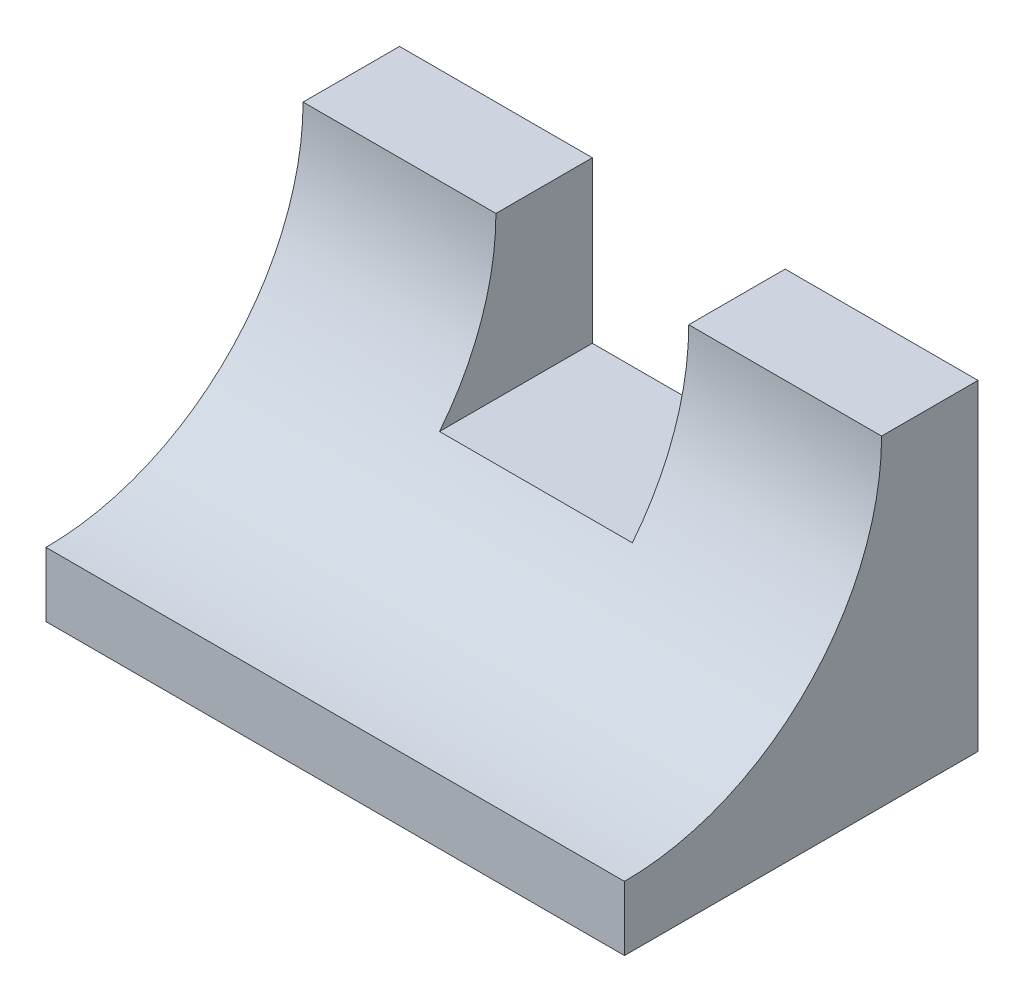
ISO-10303-21;
HEADER;
FILE_DESCRIPTION(('STEP AP214'),'2;1');
FILE_NAME('part.step','',(''),(''),'','','');
FILE_SCHEMA(('AUTOMOTIVE_DESIGN { 1 0 10303 214 1 1 1 1 }'));
ENDSEC;
DATA;
#1=APPLICATION_CONTEXT('core data for automotive mechanical design processes');
#2=APPLICATION_PROTOCOL_DEFINITION('international standard','automotive_design',2000,#1);
#3=PRODUCT_CONTEXT('',#1,'mechanical');
#4=PRODUCT('Part','Part','',(#3));
#5=PRODUCT_RELATED_PRODUCT_CATEGORY('part','',(#4));
#6=PRODUCT_DEFINITION_FORMATION('','',#4);
#7=PRODUCT_DEFINITION_CONTEXT('part definition',#1,'design');
#8=PRODUCT_DEFINITION('design','',#6,#7);
#9=PRODUCT_DEFINITION_SHAPE('','',#8);
#10=(LENGTH_UNIT() NAMED_UNIT(*) SI_UNIT(.MILLI.,.METRE.));
#11=(NAMED_UNIT(*) PLANE_ANGLE_UNIT() SI_UNIT($,.RADIAN.));
#12=(NAMED_UNIT(*) SI_UNIT($,.STERADIAN.) SOLID_ANGLE_UNIT());
#13=UNCERTAINTY_MEASURE_WITH_UNIT(LENGTH_MEASURE(1.E-05),#10,'distance_accuracy_value','');
#14=(GEOMETRIC_REPRESENTATION_CONTEXT(3) GLOBAL_UNCERTAINTY_ASSIGNED_CONTEXT((#13)) GLOBAL_UNIT_ASSIGNED_CONTEXT((#10,
#11,#12)) REPRESENTATION_CONTEXT('',''));
#15=CARTESIAN_POINT('',(0.,0.,0.));
#16=DIRECTION('',(0.,0.,1.));
#17=DIRECTION('',(1.,0.,0.));
#18=AXIS2_PLACEMENT_3D('',#15,#16,#17);
#19=CARTESIAN_POINT('',(0.,50.,-55.));
#20=DIRECTION('',(0.,-1.,0.));
#21=DIRECTION('',(0.,0.,-1.));
#22=AXIS2_PLACEMENT_3D('',#19,#20,#21);
#23=PLANE('',#22);
#24=DIRECTION('',(1.,0.,0.));
#25=VECTOR('',#24,1.);
#26=CARTESIAN_POINT('',(0.,50.,-40.));
#27=LINE('',#26,#25);
#28=CARTESIAN_POINT('',(0.,50.,-40.));
#29=VERTEX_POINT('',#28);
#30=CARTESIAN_POINT('',(30.,50.,-40.));
#31=VERTEX_POINT('',#30);
#32=EDGE_CURVE('E165',#29,#31,#27,.T.);
#33=ORIENTED_EDGE('',*,*,#32,.T.);
#34=DIRECTION('',(0.,0.,1.));
#35=VECTOR('',#34,1.);
#36=CARTESIAN_POINT('',(30.,50.,-55.));
#37=LINE('',#36,#35);
#38=CARTESIAN_POINT('',(30.,50.,-55.));
#39=VERTEX_POINT('',#38);
#40=EDGE_CURVE('E124',#39,#31,#37,.T.);
#41=ORIENTED_EDGE('',*,*,#40,.F.);
#42=DIRECTION('',(-1.,0.,0.));
#43=VECTOR('',#42,1.);
#44=CARTESIAN_POINT('',(0.,50.,-55.));
#45=LINE('',#44,#43);
#46=CARTESIAN_POINT('',(0.,50.,-55.));
#47=VERTEX_POINT('',#46);
#48=EDGE_CURVE('E120',#39,#47,#45,.T.);
#49=ORIENTED_EDGE('',*,*,#48,.T.);
#50=DIRECTION('',(0.,0.,1.));
#51=VECTOR('',#50,1.);
#52=CARTESIAN_POINT('',(0.,50.,0.));
#53=LINE('',#52,#51);
#54=EDGE_CURVE('E138',#47,#29,#53,.T.);
#55=ORIENTED_EDGE('',*,*,#54,.T.);
#56=EDGE_LOOP('',(#33,#41,#49,#55));
#57=FACE_BOUND('',#56,.T.);
#58=ADVANCED_FACE('F31',(#57),#23,.F.);
#59=CARTESIAN_POINT('',(0.,50.,0.));
#60=DIRECTION('',(1.,0.,0.));
#61=DIRECTION('',(0.,0.,-1.));
#62=AXIS2_PLACEMENT_3D('',#59,#60,#61);
#63=PLANE('',#62);
#64=DIRECTION('',(0.,-1.,0.));
#65=VECTOR('',#64,1.);
#66=CARTESIAN_POINT('',(0.,50.,0.));
#67=LINE('',#66,#65);
#68=CARTESIAN_POINT('',(0.,9.99999999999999,0.));
#69=VERTEX_POINT('',#68);
#70=CARTESIAN_POINT('',(0.,0.,0.));
#71=VERTEX_POINT('',#70);
#72=EDGE_CURVE('E163',#69,#71,#67,.T.);
#73=ORIENTED_EDGE('',*,*,#72,.F.);
#74=CARTESIAN_POINT('',(0.,50.,0.));
#75=DIRECTION('',(1.,0.,0.));
#76=DIRECTION('',(0.,0.,-1.));
#77=AXIS2_PLACEMENT_3D('',#74,#75,#76);
#78=CIRCLE('',#77,40.);
#79=EDGE_CURVE('E130',#69,#29,#78,.T.);
#80=ORIENTED_EDGE('',*,*,#79,.T.);
#81=ORIENTED_EDGE('',*,*,#54,.F.);
#82=DIRECTION('',(0.,-1.,0.));
#83=VECTOR('',#82,1.);
#84=CARTESIAN_POINT('',(0.,50.,-55.));
#85=LINE('',#84,#83);
#86=CARTESIAN_POINT('',(0.,0.,-55.));
#87=VERTEX_POINT('',#86);
#88=EDGE_CURVE('E147',#47,#87,#85,.T.);
#89=ORIENTED_EDGE('',*,*,#88,.T.);
#90=DIRECTION('',(0.,0.,1.));
#91=VECTOR('',#90,1.);
#92=CARTESIAN_POINT('',(0.,0.,0.));
#93=LINE('',#92,#91);
#94=EDGE_CURVE('E137',#87,#71,#93,.T.);
#95=ORIENTED_EDGE('',*,*,#94,.T.);
#96=EDGE_LOOP('',(#73,#80,#81,#89,#95));
#97=FACE_BOUND('',#96,.T.);
#98=ADVANCED_FACE('F33',(#97),#63,.F.);
#99=CARTESIAN_POINT('',(0.,50.,0.));
#100=DIRECTION('',(0.,0.,-1.));
#101=DIRECTION('',(-1.,0.,0.));
#102=AXIS2_PLACEMENT_3D('',#99,#100,#101);
#103=PLANE('',#102);
#104=DIRECTION('',(0.,-1.,0.));
#105=VECTOR('',#104,1.);
#106=CARTESIAN_POINT('',(90.,50.,0.));
#107=LINE('',#106,#105);
#108=CARTESIAN_POINT('',(90.,9.99999999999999,0.));
#109=VERTEX_POINT('',#108);
#110=CARTESIAN_POINT('',(90.,0.,0.));
#111=VERTEX_POINT('',#110);
#112=EDGE_CURVE('E161',#109,#111,#107,.T.);
#113=ORIENTED_EDGE('',*,*,#112,.F.);
#114=DIRECTION('',(1.,0.,0.));
#115=VECTOR('',#114,1.);
#116=CARTESIAN_POINT('',(0.,10.,0.));
#117=LINE('',#116,#115);
#118=EDGE_CURVE('E133',#109,#69,#117,.F.);
#119=ORIENTED_EDGE('',*,*,#118,.T.);
#120=ORIENTED_EDGE('',*,*,#72,.T.);
#121=DIRECTION('',(1.,0.,0.));
#122=VECTOR('',#121,1.);
#123=CARTESIAN_POINT('',(0.,0.,0.));
#124=LINE('',#123,#122);
#125=EDGE_CURVE('E150',#71,#111,#124,.T.);
#126=ORIENTED_EDGE('',*,*,#125,.T.);
#127=EDGE_LOOP('',(#113,#119,#120,#126));
#128=FACE_BOUND('',#127,.T.);
#129=ADVANCED_FACE('F192',(#128),#103,.F.);
#130=CARTESIAN_POINT('',(90.,50.,0.));
#131=DIRECTION('',(-1.,0.,0.));
#132=DIRECTION('',(0.,0.,1.));
#133=AXIS2_PLACEMENT_3D('',#130,#131,#132);
#134=PLANE('',#133);
#135=DIRECTION('',(0.,0.,-1.));
#136=VECTOR('',#135,1.);
#137=CARTESIAN_POINT('',(90.,50.,0.));
#138=LINE('',#137,#136);
#139=CARTESIAN_POINT('',(90.,50.,-40.));
#140=VERTEX_POINT('',#139);
#141=CARTESIAN_POINT('',(90.,50.,-55.));
#142=VERTEX_POINT('',#141);
#143=EDGE_CURVE('E141',#140,#142,#138,.T.);
#144=ORIENTED_EDGE('',*,*,#143,.F.);
#145=CARTESIAN_POINT('',(90.,50.,0.));
#146=DIRECTION('',(1.,0.,0.));
#147=DIRECTION('',(0.,0.,-1.));
#148=AXIS2_PLACEMENT_3D('',#145,#146,#147);
#149=CIRCLE('',#148,40.);
#150=EDGE_CURVE('E126',#109,#140,#149,.T.);
#151=ORIENTED_EDGE('',*,*,#150,.F.);
#152=ORIENTED_EDGE('',*,*,#112,.T.);
#153=DIRECTION('',(0.,0.,-1.));
#154=VECTOR('',#153,1.);
#155=CARTESIAN_POINT('',(90.,0.,0.));
#156=LINE('',#155,#154);
#157=CARTESIAN_POINT('',(90.,0.,-55.));
#158=VERTEX_POINT('',#157);
#159=EDGE_CURVE('E153',#111,#158,#156,.T.);
#160=ORIENTED_EDGE('',*,*,#159,.T.);
#161=DIRECTION('',(0.,-1.,0.));
#162=VECTOR('',#161,1.);
#163=CARTESIAN_POINT('',(90.,50.,-55.));
#164=LINE('',#163,#162);
#165=EDGE_CURVE('E158',#142,#158,#164,.T.);
#166=ORIENTED_EDGE('',*,*,#165,.F.);
#167=EDGE_LOOP('',(#144,#151,#152,#160,#166));
#168=FACE_BOUND('',#167,.T.);
#169=ADVANCED_FACE('F193',(#168),#134,.F.);
#170=CARTESIAN_POINT('',(0.,50.,-55.));
#171=DIRECTION('',(0.,0.,1.));
#172=DIRECTION('',(1.,0.,0.));
#173=AXIS2_PLACEMENT_3D('',#170,#171,#172);
#174=PLANE('',#173);
#175=ORIENTED_EDGE('',*,*,#48,.F.);
#176=DIRECTION('',(0.,-1.,0.));
#177=VECTOR('',#176,1.);
#178=CARTESIAN_POINT('',(30.,50.,-55.));
#179=LINE('',#178,#177);
#180=CARTESIAN_POINT('',(30.,25.,-55.));
#181=VERTEX_POINT('',#180);
#182=EDGE_CURVE('E103',#39,#181,#179,.T.);
#183=ORIENTED_EDGE('',*,*,#182,.T.);
#184=DIRECTION('',(1.,0.,0.));
#185=VECTOR('',#184,1.);
#186=CARTESIAN_POINT('',(30.,25.,-55.));
#187=LINE('',#186,#185);
#188=CARTESIAN_POINT('',(60.,25.,-55.));
#189=VERTEX_POINT('',#188);
#190=EDGE_CURVE('E110',#181,#189,#187,.T.);
#191=ORIENTED_EDGE('',*,*,#190,.T.);
#192=DIRECTION('',(0.,1.,0.));
#193=VECTOR('',#192,1.);
#194=CARTESIAN_POINT('',(60.,50.,-55.));
#195=LINE('',#194,#193);
#196=CARTESIAN_POINT('',(60.,50.,-55.));
#197=VERTEX_POINT('',#196);
#198=EDGE_CURVE('E107',#189,#197,#195,.T.);
#199=ORIENTED_EDGE('',*,*,#198,.T.);
#200=EDGE_CURVE('E144',#142,#197,#45,.T.);
#201=ORIENTED_EDGE('',*,*,#200,.F.);
#202=ORIENTED_EDGE('',*,*,#165,.T.);
#203=DIRECTION('',(-1.,0.,0.));
#204=VECTOR('',#203,1.);
#205=CARTESIAN_POINT('',(0.,0.,-55.));
#206=LINE('',#205,#204);
#207=EDGE_CURVE('E142',#158,#87,#206,.T.);
#208=ORIENTED_EDGE('',*,*,#207,.T.);
#209=ORIENTED_EDGE('',*,*,#88,.F.);
#210=EDGE_LOOP('',(#175,#183,#191,#199,#201,#202,#208,#209));
#211=FACE_BOUND('',#210,.T.);
#212=ADVANCED_FACE('F118',(#211),#174,.F.);
#213=ORIENTED_EDGE('',*,*,#200,.T.);
#214=DIRECTION('',(0.,0.,1.));
#215=VECTOR('',#214,1.);
#216=CARTESIAN_POINT('',(60.,50.,-55.));
#217=LINE('',#216,#215);
#218=CARTESIAN_POINT('',(60.,50.,-40.));
#219=VERTEX_POINT('',#218);
#220=EDGE_CURVE('E127',#197,#219,#217,.T.);
#221=ORIENTED_EDGE('',*,*,#220,.T.);
#222=EDGE_CURVE('E54',#219,#140,#27,.T.);
#223=ORIENTED_EDGE('',*,*,#222,.T.);
#224=ORIENTED_EDGE('',*,*,#143,.T.);
#225=EDGE_LOOP('',(#213,#221,#223,#224));
#226=FACE_BOUND('',#225,.T.);
#227=ADVANCED_FACE('F174',(#226),#23,.F.);
#228=CARTESIAN_POINT('',(0.,0.,-55.));
#229=DIRECTION('',(0.,-1.,0.));
#230=DIRECTION('',(0.,0.,-1.));
#231=AXIS2_PLACEMENT_3D('',#228,#229,#230);
#232=PLANE('',#231);
#233=ORIENTED_EDGE('',*,*,#94,.F.);
#234=ORIENTED_EDGE('',*,*,#207,.F.);
#235=ORIENTED_EDGE('',*,*,#159,.F.);
#236=ORIENTED_EDGE('',*,*,#125,.F.);
#237=EDGE_LOOP('',(#233,#234,#235,#236));
#238=FACE_BOUND('',#237,.T.);
#239=ADVANCED_FACE('F183',(#238),#232,.T.);
#240=CARTESIAN_POINT('',(0.,50.,0.));
#241=DIRECTION('',(1.,0.,0.));
#242=DIRECTION('',(0.,0.,-1.));
#243=AXIS2_PLACEMENT_3D('',#240,#241,#242);
#244=CYLINDRICAL_SURFACE('',#243,40.);
#245=DIRECTION('',(1.,0.,0.));
#246=VECTOR('',#245,1.);
#247=CARTESIAN_POINT('',(0.,25.,-31.224989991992));
#248=LINE('',#247,#246);
#249=CARTESIAN_POINT('',(60.,25.,-31.224989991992));
#250=VERTEX_POINT('',#249);
#251=CARTESIAN_POINT('',(30.,25.,-31.224989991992));
#252=VERTEX_POINT('',#251);
#253=EDGE_CURVE('E168',#250,#252,#248,.F.);
#254=ORIENTED_EDGE('',*,*,#253,.T.);
#255=CARTESIAN_POINT('',(30.,50.,0.));
#256=DIRECTION('',(-1.,0.,0.));
#257=DIRECTION('',(0.,0.,1.));
#258=AXIS2_PLACEMENT_3D('',#255,#256,#257);
#259=CIRCLE('',#258,40.);
#260=EDGE_CURVE('E11',#252,#31,#259,.F.);
#261=ORIENTED_EDGE('',*,*,#260,.T.);
#262=ORIENTED_EDGE('',*,*,#32,.F.);
#263=ORIENTED_EDGE('',*,*,#79,.F.);
#264=ORIENTED_EDGE('',*,*,#118,.F.);
#265=ORIENTED_EDGE('',*,*,#150,.T.);
#266=ORIENTED_EDGE('',*,*,#222,.F.);
#267=CARTESIAN_POINT('',(60.,50.,0.));
#268=DIRECTION('',(1.,0.,0.));
#269=DIRECTION('',(0.,0.,-1.));
#270=AXIS2_PLACEMENT_3D('',#267,#268,#269);
#271=CIRCLE('',#270,40.);
#272=EDGE_CURVE('E39',#219,#250,#271,.F.);
#273=ORIENTED_EDGE('',*,*,#272,.T.);
#274=EDGE_LOOP('',(#254,#261,#262,#263,#264,#265,#266,#273));
#275=FACE_BOUND('',#274,.T.);
#276=ADVANCED_FACE('F171',(#275),#244,.F.);
#277=CARTESIAN_POINT('',(30.,50.,-55.));
#278=DIRECTION('',(-1.,0.,0.));
#279=DIRECTION('',(0.,0.,1.));
#280=AXIS2_PLACEMENT_3D('',#277,#278,#279);
#281=PLANE('',#280);
#282=DIRECTION('',(0.,0.,1.));
#283=VECTOR('',#282,1.);
#284=CARTESIAN_POINT('',(30.,25.,-55.));
#285=LINE('',#284,#283);
#286=EDGE_CURVE('E46',#181,#252,#285,.T.);
#287=ORIENTED_EDGE('',*,*,#286,.F.);
#288=ORIENTED_EDGE('',*,*,#182,.F.);
#289=ORIENTED_EDGE('',*,*,#40,.T.);
#290=ORIENTED_EDGE('',*,*,#260,.F.);
#291=EDGE_LOOP('',(#287,#288,#289,#290));
#292=FACE_BOUND('',#291,.T.);
#293=ADVANCED_FACE('F101',(#292),#281,.F.);
#294=CARTESIAN_POINT('',(60.,50.,-55.));
#295=DIRECTION('',(1.,0.,0.));
#296=DIRECTION('',(0.,0.,-1.));
#297=AXIS2_PLACEMENT_3D('',#294,#295,#296);
#298=PLANE('',#297);
#299=ORIENTED_EDGE('',*,*,#220,.F.);
#300=ORIENTED_EDGE('',*,*,#198,.F.);
#301=DIRECTION('',(0.,0.,1.));
#302=VECTOR('',#301,1.);
#303=CARTESIAN_POINT('',(60.,25.,-55.));
#304=LINE('',#303,#302);
#305=EDGE_CURVE('E106',#189,#250,#304,.T.);
#306=ORIENTED_EDGE('',*,*,#305,.T.);
#307=ORIENTED_EDGE('',*,*,#272,.F.);
#308=EDGE_LOOP('',(#299,#300,#306,#307));
#309=FACE_BOUND('',#308,.T.);
#310=ADVANCED_FACE('F173',(#309),#298,.F.);
#311=CARTESIAN_POINT('',(30.,25.,-55.));
#312=DIRECTION('',(0.,-1.,0.));
#313=DIRECTION('',(0.,0.,-1.));
#314=AXIS2_PLACEMENT_3D('',#311,#312,#313);
#315=PLANE('',#314);
#316=ORIENTED_EDGE('',*,*,#305,.F.);
#317=ORIENTED_EDGE('',*,*,#190,.F.);
#318=ORIENTED_EDGE('',*,*,#286,.T.);
#319=ORIENTED_EDGE('',*,*,#253,.F.);
#320=EDGE_LOOP('',(#316,#317,#318,#319));
#321=FACE_BOUND('',#320,.T.);
#322=ADVANCED_FACE('F111',(#321),#315,.F.);
#323=CLOSED_SHELL('',(#58,#98,#129,#169,#212,#227,#239,#276,#293,#310,#322));
#324=MANIFOLD_SOLID_BREP('B2',#323);
#325=ADVANCED_BREP_SHAPE_REPRESENTATION('',(#18,#324),#14);
#326=SHAPE_DEFINITION_REPRESENTATION(#9,#325);
ENDSEC;
END-ISO-10303-21;
